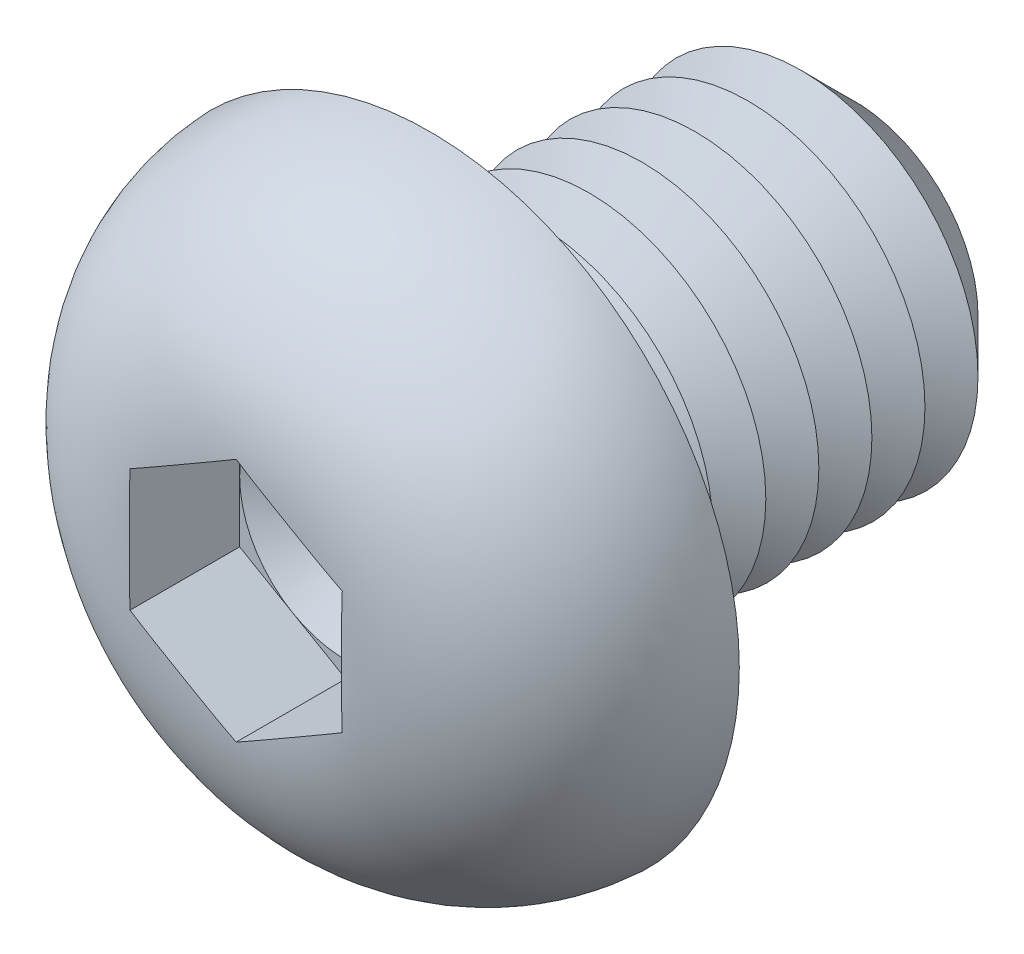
from build123d import *

# Parameters (mm, degrees)
CUT_EXTRUDE1_DEPTH  = 3.12
SKETCH4_R           = 5
BOSS_EXTRUDE1_DEPTH = 12
CHAMFER1_SIZE       = 1.5
LPATTERN1_COUNT     = 6
LPATTERN1_PITCH     = 1.5
FILLET2_R           = 0.6


with BuildPart() as part:
    # Sketch2 → Revolve1 (revolve)
    with BuildSketch(Plane(origin=(0, 0, 0), x_dir=(0, 0, -1), z_dir=(1, 0, 0)), mode=Mode.PRIVATE) as revolve1_sk:
        with BuildLine():
            Line((0, 0), (-5.5, 0))
            Line((-5.5, 0), (-5.5, 2.957763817))
            ThreePointArc((-5.5, 2.957763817), (-3.905948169, 6.951508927), (0, 8.75))
            Line((0, 8.75), (0, 0))
        make_face()
    revolve(revolve1_sk.sketch.rotate(Axis((0, 0, 47.934239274), (0, 0, -1)), 90), axis=Axis((0, 0, 47.934239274), (0, 0, -1)))

    # Sketch3 → Cut-Extrude1 (cut)
    with BuildSketch(Plane.XY.offset(5.5)):
        Polygon((0, 3.464101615), (-3, 1.732050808), (-3, -1.732050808), (0, -3.464101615), (3, -1.732050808), (3, 1.732050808), align=None)
    extrude(amount=-CUT_EXTRUDE1_DEPTH, mode=Mode.SUBTRACT)

    # Sketch4 → Boss-Extrude1 (add)
    with BuildSketch(Plane(origin=(0, 0, 0), x_dir=(-1, 0, 0), z_dir=(0, 0, -1))):
        with Locations(Location((0, 0, 0), (0, 0, 180))):
            Circle(SKETCH4_R)
    extrude(amount=BOSS_EXTRUDE1_DEPTH)

    # Chamfer1
    chamfer1_edges = [part.edges().sort_by_distance(p)[0] for p in [
        (-5, 0, -12),
    ]]
    chamfer(chamfer1_edges, length=CHAMFER1_SIZE)

    # Sketch5 → Cut-Revolve1 (revolve, cut)
    with BuildSketch(Plane(origin=(0, 0, 0), x_dir=(0, 0, -1), z_dir=(1, 0, 0)), mode=Mode.PRIVATE) as cut_revolve1_sk:
        Polygon((1.5, 5), (3, 5), (2.25, 3.700961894), align=None)
    cut_revolve1 = revolve(cut_revolve1_sk.sketch.rotate(Axis((0, 0, 47.934239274), (0, 0, -1)), 90), axis=Axis((0, 0, 47.934239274), (0, 0, -1)), mode=Mode.SUBTRACT)

    # LPattern1: Cut-Revolve1 ×6
    with Locations(*[(0, 0, -i * LPATTERN1_PITCH) for i in range(1, LPATTERN1_COUNT)]):
        add(cut_revolve1, mode=Mode.SUBTRACT)

    # Fillet2
    fillet2_edges = [part.edges().sort_by_distance(p)[0] for p in [
        (-5, 0, 0),
    ]]
    fillet(fillet2_edges, radius=FILLET2_R)

    # Cut-Extrude2 cone 1 section (on through the dimple's axis) → Cut-Extrude2 (revolve, cut)
    with BuildSketch(Plane(origin=(0, 0, 2.38), x_dir=(0, -1, 0), z_dir=(1, 0, 0))):
        Polygon((0, 0), (3, 0), (0, 1.732050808), align=None)
    revolve(axis=Axis((0, 0, 2.38), (0, 0, -1)), mode=Mode.SUBTRACT)


solid = part.part
